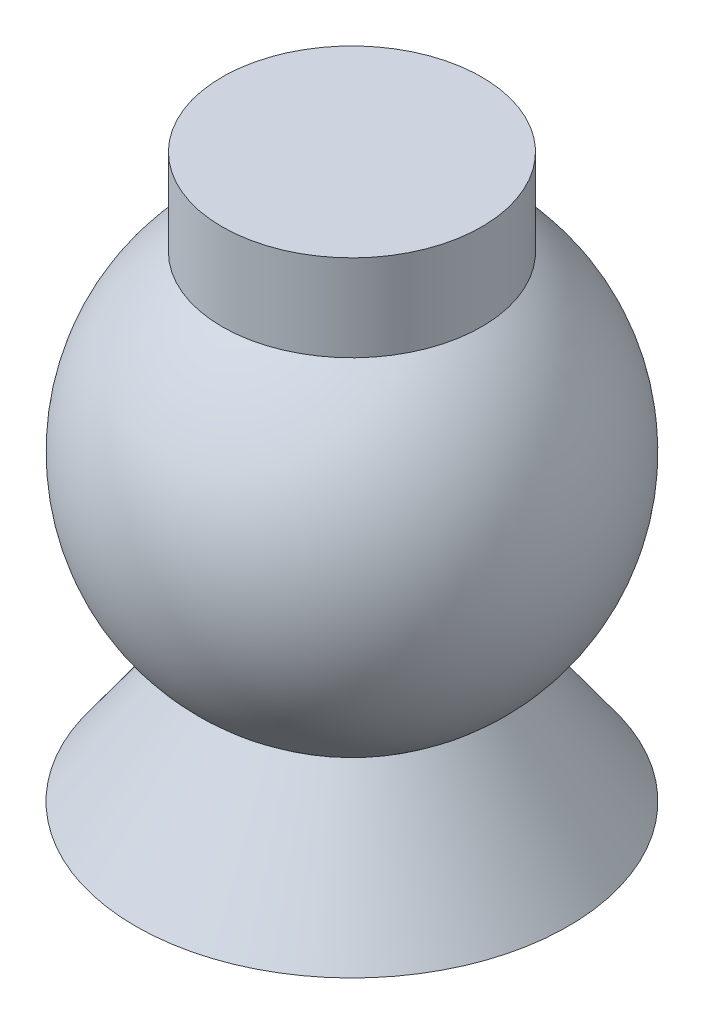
ISO-10303-21;
HEADER;
FILE_DESCRIPTION(('STEP AP214'),'2;1');
FILE_NAME('part.step','',(''),(''),'','','');
FILE_SCHEMA(('AUTOMOTIVE_DESIGN { 1 0 10303 214 1 1 1 1 }'));
ENDSEC;
DATA;
#1=APPLICATION_CONTEXT('core data for automotive mechanical design processes');
#2=APPLICATION_PROTOCOL_DEFINITION('international standard','automotive_design',2000,#1);
#3=PRODUCT_CONTEXT('',#1,'mechanical');
#4=PRODUCT('Part','Part','',(#3));
#5=PRODUCT_RELATED_PRODUCT_CATEGORY('part','',(#4));
#6=PRODUCT_DEFINITION_FORMATION('','',#4);
#7=PRODUCT_DEFINITION_CONTEXT('part definition',#1,'design');
#8=PRODUCT_DEFINITION('design','',#6,#7);
#9=PRODUCT_DEFINITION_SHAPE('','',#8);
#10=(LENGTH_UNIT() NAMED_UNIT(*) SI_UNIT(.MILLI.,.METRE.));
#11=(NAMED_UNIT(*) PLANE_ANGLE_UNIT() SI_UNIT($,.RADIAN.));
#12=(NAMED_UNIT(*) SI_UNIT($,.STERADIAN.) SOLID_ANGLE_UNIT());
#13=UNCERTAINTY_MEASURE_WITH_UNIT(LENGTH_MEASURE(1.E-05),#10,'distance_accuracy_value','');
#14=(GEOMETRIC_REPRESENTATION_CONTEXT(3) GLOBAL_UNCERTAINTY_ASSIGNED_CONTEXT((#13)) GLOBAL_UNIT_ASSIGNED_CONTEXT((#10,
#11,#12)) REPRESENTATION_CONTEXT('',''));
#15=CARTESIAN_POINT('',(0.,0.,0.));
#16=DIRECTION('',(0.,0.,1.));
#17=DIRECTION('',(1.,0.,0.));
#18=AXIS2_PLACEMENT_3D('',#15,#16,#17);
#19=CARTESIAN_POINT('',(0.,12.,0.));
#20=DIRECTION('',(0.,1.,0.));
#21=DIRECTION('',(0.,0.,1.));
#22=AXIS2_PLACEMENT_3D('',#19,#20,#21);
#23=PLANE('',#22);
#24=CARTESIAN_POINT('',(0.,12.,0.));
#25=DIRECTION('',(0.,1.,0.));
#26=DIRECTION('',(0.,0.,1.));
#27=AXIS2_PLACEMENT_3D('',#24,#25,#26);
#28=CIRCLE('',#27,5.99999999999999);
#29=CARTESIAN_POINT('',(0.,12.,5.99999999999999));
#30=VERTEX_POINT('',#29);
#31=EDGE_CURVE('E10',#30,#30,#28,.T.);
#32=ORIENTED_EDGE('',*,*,#31,.T.);
#33=EDGE_LOOP('',(#32));
#34=FACE_BOUND('',#33,.T.);
#35=ADVANCED_FACE('F29',(#34),#23,.T.);
#36=CARTESIAN_POINT('',(0.,28.6579779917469,0.));
#37=DIRECTION('',(0.,1.,0.));
#38=DIRECTION('',(0.,0.,1.));
#39=AXIS2_PLACEMENT_3D('',#36,#37,#38);
#40=CYLINDRICAL_SURFACE('',#39,5.99999999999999);
#41=CARTESIAN_POINT('',(0.,8.00000000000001,0.));
#42=DIRECTION('',(0.,1.,0.));
#43=DIRECTION('',(0.,0.,1.));
#44=AXIS2_PLACEMENT_3D('',#41,#42,#43);
#45=CIRCLE('',#44,5.99999999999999);
#46=CARTESIAN_POINT('',(-5.99999999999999,8.00000000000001,0.));
#47=VERTEX_POINT('',#46);
#48=EDGE_CURVE('E35',#47,#47,#45,.T.);
#49=ORIENTED_EDGE('',*,*,#48,.T.);
#50=EDGE_LOOP('',(#49));
#51=FACE_BOUND('',#50,.T.);
#52=ORIENTED_EDGE('',*,*,#31,.F.);
#53=EDGE_LOOP('',(#52));
#54=FACE_BOUND('',#53,.T.);
#55=ADVANCED_FACE('F61',(#51,#54),#40,.T.);
#56=CARTESIAN_POINT('',(0.,0.,0.));
#57=DIRECTION('',(0.,1.,0.));
#58=DIRECTION('',(-1.,0.,0.));
#59=AXIS2_PLACEMENT_3D('',#56,#57,#58);
#60=SPHERICAL_SURFACE('',#59,10.);
#61=CARTESIAN_POINT('',(0.,-8.13733471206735,0.));
#62=DIRECTION('',(0.,1.,0.));
#63=DIRECTION('',(0.,0.,1.));
#64=AXIS2_PLACEMENT_3D('',#61,#62,#63);
#65=CIRCLE('',#64,5.81238193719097);
#66=CARTESIAN_POINT('',(-5.81238193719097,-8.13733471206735,0.));
#67=VERTEX_POINT('',#66);
#68=EDGE_CURVE('E39',#67,#67,#65,.T.);
#69=CARTESIAN_POINT('',(-5.81238193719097,-8.13733471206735,0.));
#70=CARTESIAN_POINT('',(-5.97155960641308,-8.02364508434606,0.));
#71=CARTESIAN_POINT('',(-6.12739263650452,-7.90527420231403,0.));
#72=CARTESIAN_POINT('',(-6.43185250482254,-7.65960168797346,0.));
#73=CARTESIAN_POINT('',(-6.58047934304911,-7.53230005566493,0.));
#74=CARTESIAN_POINT('',(-6.87000991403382,-7.26919779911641,0.));
#75=CARTESIAN_POINT('',(-7.01091364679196,-7.13339717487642,0.));
#76=CARTESIAN_POINT('',(-7.28451432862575,-6.85376619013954,0.));
#77=CARTESIAN_POINT('',(-7.4172112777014,-6.70993582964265,0.));
#78=CARTESIAN_POINT('',(-7.6739411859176,-6.41474006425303,0.));
#79=CARTESIAN_POINT('',(-7.79797414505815,-6.26337465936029,0.));
#80=CARTESIAN_POINT('',(-8.03694917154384,-5.95363002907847,0.));
#81=CARTESIAN_POINT('',(-8.15189123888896,-5.79525080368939,0.));
#82=CARTESIAN_POINT('',(-8.37228874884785,-5.4720237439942,0.));
#83=CARTESIAN_POINT('',(-8.47774419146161,-5.30717590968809,0.));
#84=CARTESIAN_POINT('',(-8.67880541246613,-4.97157915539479,0.));
#85=CARTESIAN_POINT('',(-8.77441119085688,-4.80083023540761,0.));
#86=CARTESIAN_POINT('',(-8.95544394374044,-4.45401913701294,0.));
#87=CARTESIAN_POINT('',(-9.04087091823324,-4.27795695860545,0.));
#88=CARTESIAN_POINT('',(-9.20125196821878,-3.92112546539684,0.));
#89=CARTESIAN_POINT('',(-9.27620604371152,-3.74035615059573,0.));
#90=CARTESIAN_POINT('',(-9.41538325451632,-3.3747327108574,0.));
#91=CARTESIAN_POINT('',(-9.47960638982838,-3.18987858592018,0.));
#92=CARTESIAN_POINT('',(-9.59710062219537,-2.81672191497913,0.));
#93=CARTESIAN_POINT('',(-9.65037171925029,-2.62841936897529,0.));
#94=CARTESIAN_POINT('',(-9.74577848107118,-2.24901411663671,0.));
#95=CARTESIAN_POINT('',(-9.78791414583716,-2.05791141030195,0.));
#96=CARTESIAN_POINT('',(-9.86090498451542,-1.67356373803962,0.));
#97=CARTESIAN_POINT('',(-9.89176015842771,-1.48031877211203,0.));
#98=CARTESIAN_POINT('',(-9.94208379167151,-1.09235185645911,0.));
#99=CARTESIAN_POINT('',(-9.96155225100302,-0.89762990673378,0.));
#100=CARTESIAN_POINT('',(-9.98903543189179,-0.507379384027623,0.));
#101=CARTESIAN_POINT('',(-9.99705015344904,-0.311850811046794,0.));
#102=CARTESIAN_POINT('',(-10.001598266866,0.0793398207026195,0.));
#103=CARTESIAN_POINT('',(-9.9981316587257,0.275001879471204,0.));
#104=CARTESIAN_POINT('',(-9.97972904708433,0.665785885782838,0.));
#105=CARTESIAN_POINT('',(-9.96479304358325,0.860907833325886,0.));
#106=CARTESIAN_POINT('',(-9.92350306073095,1.24993987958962,0.));
#107=CARTESIAN_POINT('',(-9.89714908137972,1.44384997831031,0.));
#108=CARTESIAN_POINT('',(-9.83311387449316,1.82979076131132,0.));
#109=CARTESIAN_POINT('',(-9.79543264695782,2.02182144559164,0.));
#110=CARTESIAN_POINT('',(-9.70887266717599,2.40334230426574,0.));
#111=CARTESIAN_POINT('',(-9.65999391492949,2.59283247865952,0.));
#112=CARTESIAN_POINT('',(-9.55120715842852,2.96861996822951,0.));
#113=CARTESIAN_POINT('',(-9.49129915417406,3.15491728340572,0.));
#114=CARTESIAN_POINT('',(-9.36066013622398,3.5236776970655,0.));
#115=CARTESIAN_POINT('',(-9.28992912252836,3.70614079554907,0.));
#116=CARTESIAN_POINT('',(-9.13788758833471,4.0666046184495,0.));
#117=CARTESIAN_POINT('',(-9.05657706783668,4.24460534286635,0.));
#118=CARTESIAN_POINT('',(-8.88365644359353,4.59553162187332,0.));
#119=CARTESIAN_POINT('',(-8.79204633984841,4.76845717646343,0.));
#120=CARTESIAN_POINT('',(-8.59884193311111,5.10863779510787,0.));
#121=CARTESIAN_POINT('',(-8.49724763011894,5.27589285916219,0.));
#122=CARTESIAN_POINT('',(-8.28442457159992,5.60415668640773,0.));
#123=CARTESIAN_POINT('',(-8.17319581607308,5.76516544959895,0.));
#124=CARTESIAN_POINT('',(-7.94148680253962,6.0803824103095,0.));
#125=CARTESIAN_POINT('',(-7.82100654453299,6.23459060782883,0.));
#126=CARTESIAN_POINT('',(-7.57120919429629,6.53567542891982,0.));
#127=CARTESIAN_POINT('',(-7.44189210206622,6.68255205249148,0.));
#128=CARTESIAN_POINT('',(-7.17486666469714,6.96846853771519,0.));
#129=CARTESIAN_POINT('',(-7.03715831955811,7.10750839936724,0.));
#130=CARTESIAN_POINT('',(-6.75382301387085,7.37727098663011,0.));
#131=CARTESIAN_POINT('',(-6.6081960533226,7.50799371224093,0.));
#132=CARTESIAN_POINT('',(-6.30953025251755,7.76067836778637,0.));
#133=CARTESIAN_POINT('',(-6.15649141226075,7.88264029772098,0.));
#134=CARTESIAN_POINT('',(-5.99999999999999,8.00000000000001,0.));
#135=B_SPLINE_CURVE_WITH_KNOTS('',3,(#69,#70,#71,#72,#73,#74,#75,#76,#77,#78,#79,#80,#81,#82,
#83,#84,#85,#86,#87,#88,#89,#90,#91,#92,#93,#94,#95,#96,#97,#98,#99,#100,#101,#102,#103,#104,
#105,#106,#107,#108,#109,#110,#111,#112,#113,#114,#115,#116,#117,#118,#119,#120,#121,#122,#123,
#124,#125,#126,#127,#128,#129,#130,#131,#132,#133,#134),.UNSPECIFIED.,.F.,.F.,(4,2,2,2,2,2,2,2,
2,2,2,2,2,2,2,2,2,2,2,2,2,2,2,2,2,2,2,2,2,2,2,2,4),(0.,0.58674144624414,1.17348289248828,
1.76022433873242,2.34696578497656,2.93370723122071,3.52044867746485,4.10719012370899,
4.69393156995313,5.28067301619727,5.86741446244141,6.45415590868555,7.0408973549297,
7.62763880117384,8.21438024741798,8.80112169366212,9.38786313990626,9.9746045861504,
10.5613460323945,11.1480874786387,11.7348289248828,12.321570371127,12.9083118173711,
13.4950532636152,14.0817947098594,14.6685361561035,15.2552776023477,15.8420190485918,
16.428760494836,17.0155019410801,17.6022433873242,18.1889848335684,18.7757262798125),.UNSPECIFIED.);
#136=EDGE_CURVE('BSEAM58',#67,#47,#135,.T.);
#137=ORIENTED_EDGE('',*,*,#68,.T.);
#138=ORIENTED_EDGE('',*,*,#48,.F.);
#139=ORIENTED_EDGE('',*,*,#136,.T.);
#140=ORIENTED_EDGE('',*,*,#136,.F.);
#141=EDGE_LOOP('',(#137,#139,#138,#140));
#142=FACE_BOUND('',#141,.T.);
#143=ADVANCED_FACE('F58',(#142),#60,.T.);
#144=CARTESIAN_POINT('',(0.,-8.13733471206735,0.));
#145=DIRECTION('',(0.,-1.,0.));
#146=DIRECTION('',(0.,0.,-1.));
#147=AXIS2_PLACEMENT_3D('',#144,#145,#146);
#148=CONICAL_SURFACE('',#147,5.81238193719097,0.62024948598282);
#149=CARTESIAN_POINT('',(0.,-14.,0.));
#150=DIRECTION('',(0.,1.,0.));
#151=DIRECTION('',(0.,0.,1.));
#152=AXIS2_PLACEMENT_3D('',#149,#150,#151);
#153=CIRCLE('',#152,9.99999999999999);
#154=CARTESIAN_POINT('',(0.,-14.,9.99999999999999));
#155=VERTEX_POINT('',#154);
#156=EDGE_CURVE('E43',#155,#155,#153,.T.);
#157=ORIENTED_EDGE('',*,*,#156,.T.);
#158=EDGE_LOOP('',(#157));
#159=FACE_BOUND('',#158,.T.);
#160=ORIENTED_EDGE('',*,*,#68,.F.);
#161=EDGE_LOOP('',(#160));
#162=FACE_BOUND('',#161,.T.);
#163=ADVANCED_FACE('F49',(#159,#162),#148,.T.);
#164=CARTESIAN_POINT('',(-9.99999999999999,-14.,0.));
#165=DIRECTION('',(0.,-1.,0.));
#166=DIRECTION('',(0.,0.,-1.));
#167=AXIS2_PLACEMENT_3D('',#164,#165,#166);
#168=PLANE('',#167);
#169=ORIENTED_EDGE('',*,*,#156,.F.);
#170=EDGE_LOOP('',(#169));
#171=FACE_BOUND('',#170,.T.);
#172=ADVANCED_FACE('F52',(#171),#168,.T.);
#173=CLOSED_SHELL('',(#35,#55,#143,#163,#172));
#174=MANIFOLD_SOLID_BREP('B2',#173);
#175=ADVANCED_BREP_SHAPE_REPRESENTATION('',(#18,#174),#14);
#176=SHAPE_DEFINITION_REPRESENTATION(#9,#175);
ENDSEC;
END-ISO-10303-21;
